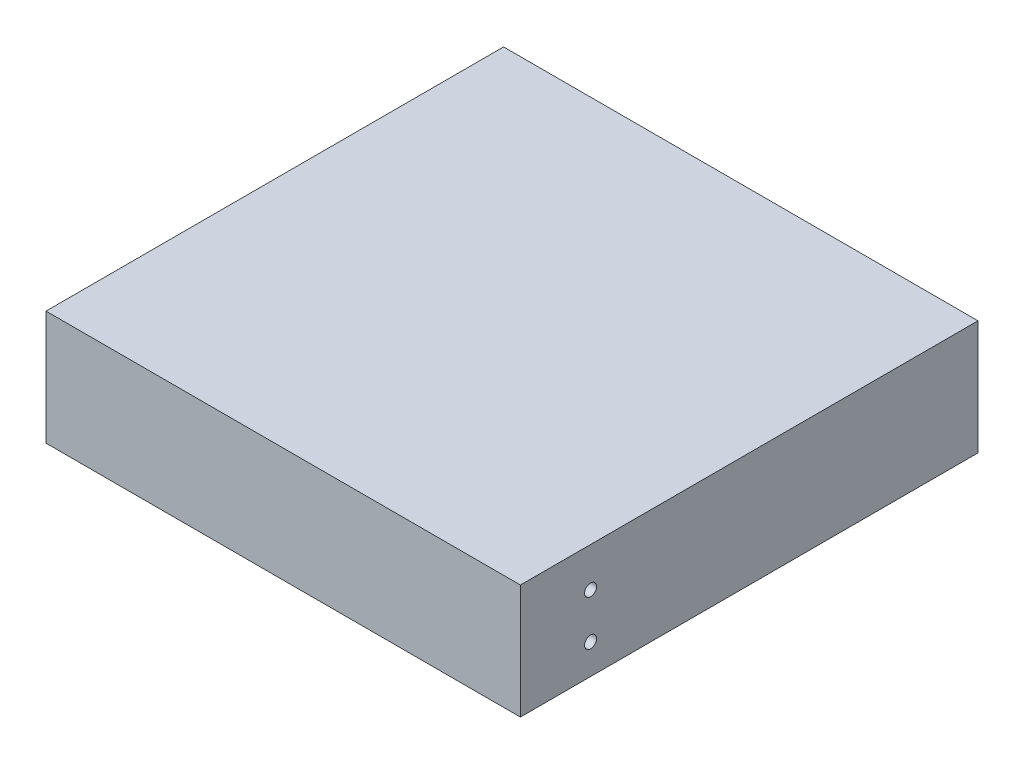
from build123d import *

# Parameters (mm, degrees)
SKETCH2_W          = 304.8
SKETCH2_H          = 76.2
EXTRUDE1_DEPTH     = 316
SKETCH3_R          = 4
CUT_EXTRUDE1_DEPTH = 20
LPATTERN1_COUNT    = 2
LPATTERN1_PITCH    = 30


with BuildPart() as part:
    # Sketch2 → Extrude1 (new body)
    with BuildSketch(Plane(origin=(0, 0, 0), x_dir=(0, 0, -1), z_dir=(1, 0, 0))):
        with Locations((152.4, 38.1)):
            Rectangle(SKETCH2_W, SKETCH2_H)
    extrude(amount=-EXTRUDE1_DEPTH)

    # Sketch3 → Cut-Extrude1 (cut)
    with BuildSketch(Plane(origin=(0, 0, 0), x_dir=(0, 0, -1), z_dir=(1, 0, 0))):
        with Locations((46.721247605, 20)):
            Circle(SKETCH3_R)
    cut_extrude1 = extrude(amount=-CUT_EXTRUDE1_DEPTH, mode=Mode.SUBTRACT)

    # LPattern1: Cut-Extrude1 ×2
    with Locations(*[(0, i * LPATTERN1_PITCH, 0) for i in range(1, LPATTERN1_COUNT)]):
        add(cut_extrude1, mode=Mode.SUBTRACT)


solid = part.part
